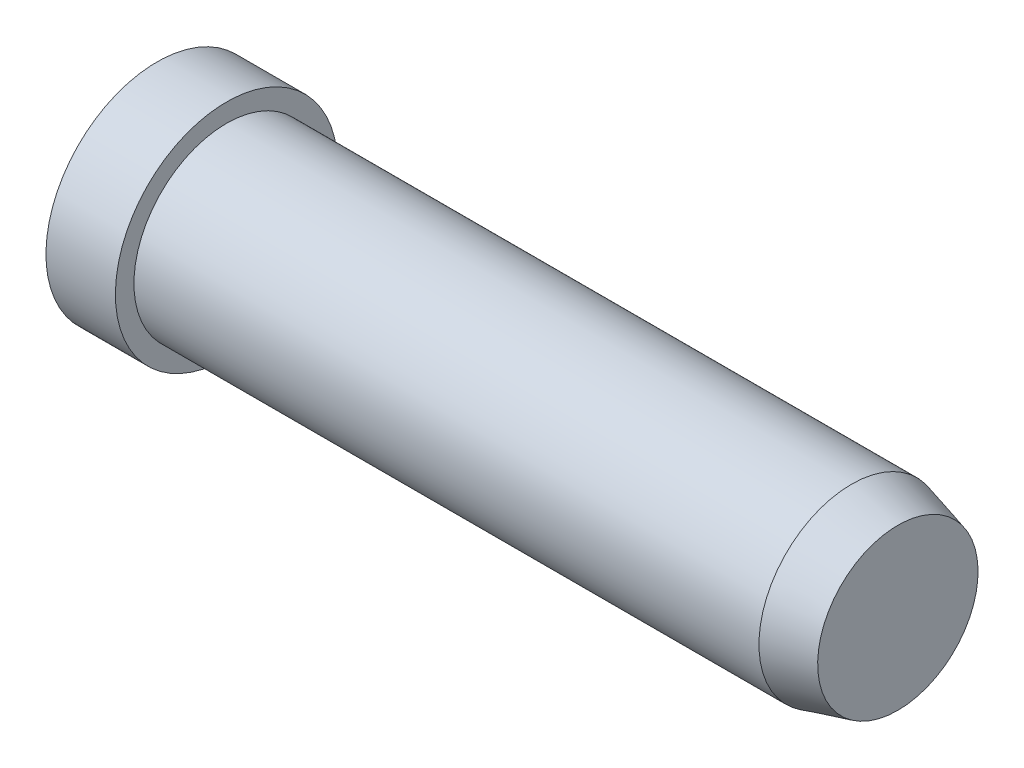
ISO-10303-21;
HEADER;
FILE_DESCRIPTION(('STEP AP214'),'2;1');
FILE_NAME('part.step','',(''),(''),'','','');
FILE_SCHEMA(('AUTOMOTIVE_DESIGN { 1 0 10303 214 1 1 1 1 }'));
ENDSEC;
DATA;
#1=APPLICATION_CONTEXT('core data for automotive mechanical design processes');
#2=APPLICATION_PROTOCOL_DEFINITION('international standard','automotive_design',2000,#1);
#3=PRODUCT_CONTEXT('',#1,'mechanical');
#4=PRODUCT('Part','Part','',(#3));
#5=PRODUCT_RELATED_PRODUCT_CATEGORY('part','',(#4));
#6=PRODUCT_DEFINITION_FORMATION('','',#4);
#7=PRODUCT_DEFINITION_CONTEXT('part definition',#1,'design');
#8=PRODUCT_DEFINITION('design','',#6,#7);
#9=PRODUCT_DEFINITION_SHAPE('','',#8);
#10=(LENGTH_UNIT() NAMED_UNIT(*) SI_UNIT(.MILLI.,.METRE.));
#11=(NAMED_UNIT(*) PLANE_ANGLE_UNIT() SI_UNIT($,.RADIAN.));
#12=(NAMED_UNIT(*) SI_UNIT($,.STERADIAN.) SOLID_ANGLE_UNIT());
#13=UNCERTAINTY_MEASURE_WITH_UNIT(LENGTH_MEASURE(1.E-05),#10,'distance_accuracy_value','');
#14=(GEOMETRIC_REPRESENTATION_CONTEXT(3) GLOBAL_UNCERTAINTY_ASSIGNED_CONTEXT((#13)) GLOBAL_UNIT_ASSIGNED_CONTEXT((#10,
#11,#12)) REPRESENTATION_CONTEXT('',''));
#15=CARTESIAN_POINT('',(0.,0.,0.));
#16=DIRECTION('',(0.,0.,1.));
#17=DIRECTION('',(1.,0.,0.));
#18=AXIS2_PLACEMENT_3D('',#15,#16,#17);
#19=CARTESIAN_POINT('',(0.,0.,0.));
#20=DIRECTION('',(1.,0.,0.));
#21=DIRECTION('',(0.,1.,0.));
#22=AXIS2_PLACEMENT_3D('',#19,#20,#21);
#23=PLANE('',#22);
#24=CARTESIAN_POINT('',(0.,0.,0.));
#25=DIRECTION('',(-1.,0.,0.));
#26=DIRECTION('',(0.,-1.,0.));
#27=AXIS2_PLACEMENT_3D('',#24,#25,#26);
#28=CIRCLE('',#27,24.);
#29=CARTESIAN_POINT('',(0.,-24.,0.));
#30=VERTEX_POINT('',#29);
#31=EDGE_CURVE('E10',#30,#30,#28,.T.);
#32=ORIENTED_EDGE('',*,*,#31,.T.);
#33=EDGE_LOOP('',(#32));
#34=FACE_BOUND('',#33,.T.);
#35=ADVANCED_FACE('F28',(#34),#23,.F.);
#36=CARTESIAN_POINT('',(160.,0.,0.));
#37=DIRECTION('',(-1.,0.,0.));
#38=DIRECTION('',(0.,-1.,0.));
#39=AXIS2_PLACEMENT_3D('',#36,#37,#38);
#40=CYLINDRICAL_SURFACE('',#39,24.);
#41=ORIENTED_EDGE('',*,*,#31,.F.);
#42=EDGE_LOOP('',(#41));
#43=FACE_BOUND('',#42,.T.);
#44=CARTESIAN_POINT('',(15.,0.,0.));
#45=DIRECTION('',(-1.,0.,0.));
#46=DIRECTION('',(0.,-1.,0.));
#47=AXIS2_PLACEMENT_3D('',#44,#45,#46);
#48=CIRCLE('',#47,24.);
#49=CARTESIAN_POINT('',(15.,-24.,0.));
#50=VERTEX_POINT('',#49);
#51=EDGE_CURVE('E34',#50,#50,#48,.T.);
#52=ORIENTED_EDGE('',*,*,#51,.T.);
#53=EDGE_LOOP('',(#52));
#54=FACE_BOUND('',#53,.T.);
#55=ADVANCED_FACE('F63',(#43,#54),#40,.T.);
#56=CARTESIAN_POINT('',(15.,24.,0.));
#57=DIRECTION('',(-1.,0.,0.));
#58=DIRECTION('',(0.,-1.,0.));
#59=AXIS2_PLACEMENT_3D('',#56,#57,#58);
#60=PLANE('',#59);
#61=ORIENTED_EDGE('',*,*,#51,.F.);
#62=EDGE_LOOP('',(#61));
#63=FACE_BOUND('',#62,.T.);
#64=CARTESIAN_POINT('',(15.,0.,0.));
#65=DIRECTION('',(-1.,0.,0.));
#66=DIRECTION('',(0.,-1.,0.));
#67=AXIS2_PLACEMENT_3D('',#64,#65,#66);
#68=CIRCLE('',#67,20.);
#69=CARTESIAN_POINT('',(15.,-20.,0.));
#70=VERTEX_POINT('',#69);
#71=EDGE_CURVE('E38',#70,#70,#68,.T.);
#72=ORIENTED_EDGE('',*,*,#71,.T.);
#73=EDGE_LOOP('',(#72));
#74=FACE_BOUND('',#73,.T.);
#75=ADVANCED_FACE('F67',(#63,#74),#60,.F.);
#76=CARTESIAN_POINT('',(160.,0.,0.));
#77=DIRECTION('',(-1.,0.,0.));
#78=DIRECTION('',(0.,-1.,0.));
#79=AXIS2_PLACEMENT_3D('',#76,#77,#78);
#80=CYLINDRICAL_SURFACE('',#79,20.);
#81=ORIENTED_EDGE('',*,*,#71,.F.);
#82=EDGE_LOOP('',(#81));
#83=FACE_BOUND('',#82,.T.);
#84=CARTESIAN_POINT('',(150.,0.,0.));
#85=DIRECTION('',(-1.,0.,0.));
#86=DIRECTION('',(0.,-1.,0.));
#87=AXIS2_PLACEMENT_3D('',#84,#85,#86);
#88=CIRCLE('',#87,20.);
#89=CARTESIAN_POINT('',(150.,-20.,0.));
#90=VERTEX_POINT('',#89);
#91=EDGE_CURVE('E42',#90,#90,#88,.T.);
#92=ORIENTED_EDGE('',*,*,#91,.T.);
#93=EDGE_LOOP('',(#92));
#94=FACE_BOUND('',#93,.T.);
#95=ADVANCED_FACE('F59',(#83,#94),#80,.T.);
#96=CARTESIAN_POINT('',(160.,0.,0.));
#97=DIRECTION('',(-1.,0.,0.));
#98=DIRECTION('',(0.,-1.,0.));
#99=AXIS2_PLACEMENT_3D('',#96,#97,#98);
#100=CONICAL_SURFACE('',#99,17.3205080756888,0.26179938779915);
#101=ORIENTED_EDGE('',*,*,#91,.F.);
#102=EDGE_LOOP('',(#101));
#103=FACE_BOUND('',#102,.T.);
#104=CARTESIAN_POINT('',(160.,0.,0.));
#105=DIRECTION('',(-1.,0.,0.));
#106=DIRECTION('',(0.,-1.,0.));
#107=AXIS2_PLACEMENT_3D('',#104,#105,#106);
#108=CIRCLE('',#107,17.3205080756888);
#109=CARTESIAN_POINT('',(160.,-17.3205080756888,0.));
#110=VERTEX_POINT('',#109);
#111=EDGE_CURVE('E47',#110,#110,#108,.T.);
#112=ORIENTED_EDGE('',*,*,#111,.T.);
#113=EDGE_LOOP('',(#112));
#114=FACE_BOUND('',#113,.T.);
#115=ADVANCED_FACE('F51',(#103,#114),#100,.T.);
#116=CARTESIAN_POINT('',(160.,17.3205080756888,0.));
#117=DIRECTION('',(-1.,0.,0.));
#118=DIRECTION('',(0.,-1.,0.));
#119=AXIS2_PLACEMENT_3D('',#116,#117,#118);
#120=PLANE('',#119);
#121=ORIENTED_EDGE('',*,*,#111,.F.);
#122=EDGE_LOOP('',(#121));
#123=FACE_BOUND('',#122,.T.);
#124=ADVANCED_FACE('F53',(#123),#120,.F.);
#125=CLOSED_SHELL('',(#35,#55,#75,#95,#115,#124));
#126=MANIFOLD_SOLID_BREP('B2',#125);
#127=ADVANCED_BREP_SHAPE_REPRESENTATION('',(#18,#126),#14);
#128=SHAPE_DEFINITION_REPRESENTATION(#9,#127);
ENDSEC;
END-ISO-10303-21;
